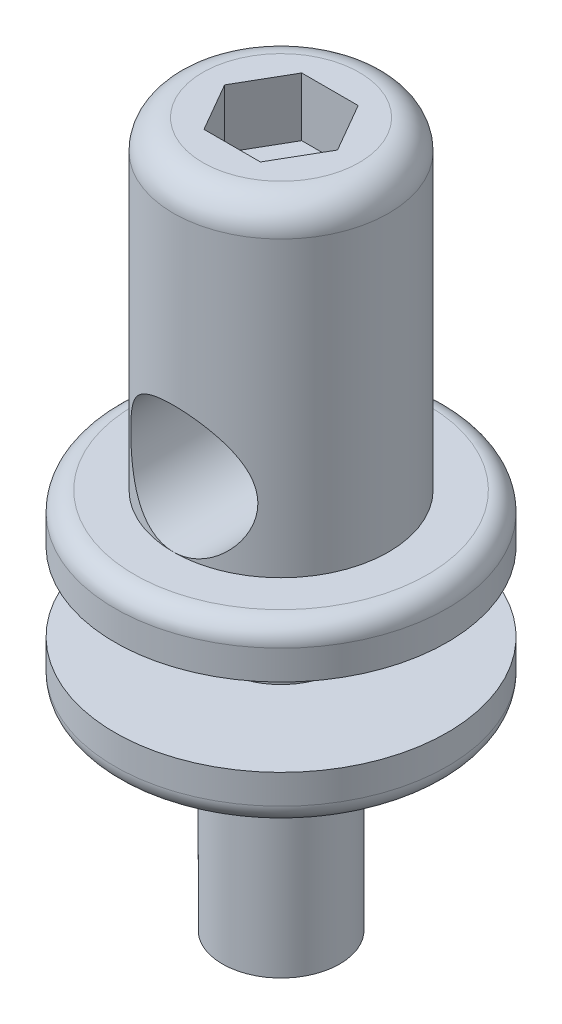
from build123d import *

# Parameters (mm, degrees)
SCHIZZO1_R                    = 5.5
ESTRUSIONE1_DEPTH             = 19
SCHIZZO2_R                    = 3
ESTRUSIONE2_DEPTH             = 17
TAGLIO_ESTRUSIONE1_DEPTH      = 3
RACCORDO1_R                   = 1.5
TAGLIO_ESTRUSIONE2_DEPTH      = 21.530465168
TAGLIO_ESTRUSIONE2_DEPTH_BACK = 21.530465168
SCHIZZO4_R                    = 3.25
SCHIZZO5_R                    = 8.5
SCHIZZO5_R_2                  = 5.5
ESTRUSIONE3_DEPTH             = 2.5
RACCORDO2_R                   = 1
SCHIZZO6_R                    = 8.5
SCHIZZO6_R_2                  = 3
ESTRUSIONE4_DEPTH             = 2.5
RACCORDO3_R                   = 1


with BuildPart() as part:
    # Schizzo1 → Estrusione1 (new body)
    with BuildSketch(Plane(origin=(0, 0, 0), x_dir=(1, 0, 0), z_dir=(0, 1, 0))):
        with Locations(Location((0, 0, 0), (0, 0, 270))):
            Circle(SCHIZZO1_R)
    extrude(amount=ESTRUSIONE1_DEPTH)

    # Schizzo2 → Estrusione2 (add)
    with BuildSketch(Plane.XZ):
        with Locations(Location((0, 0, 0), (0, 0, 90))):
            Circle(SCHIZZO2_R)
    extrude(amount=ESTRUSIONE2_DEPTH)

    # Schizzo3 → Taglio-Estrusione1 (cut)
    with BuildSketch(Plane(origin=(0, 19, 0), x_dir=(-1, 0, 0), z_dir=(0, 1, 0))):
        Polygon((-2.886751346, 0), (-1.443375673, -2.5), (1.443375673, -2.5), (2.886751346, 0), (1.443375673, 2.5), (-1.443375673, 2.5), align=None)
    extrude(amount=-TAGLIO_ESTRUSIONE1_DEPTH, mode=Mode.SUBTRACT)

    # Raccordo1
    raccordo1_edges = [part.edges().sort_by_distance(p)[0] for p in [
        (0, 19, -5.5),
    ]]
    fillet(raccordo1_edges, radius=RACCORDO1_R)

    # Schizzo4 → Taglio-Estrusione2 (cut, two sides: drawn at the far end of the back side and taken through both)
    with BuildSketch(Plane.XY.offset(-TAGLIO_ESTRUSIONE2_DEPTH_BACK)):
        with Locations(Location((0, 5.75, 0), (0, 0, 90.000000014))):
            Circle(SCHIZZO4_R)
    extrude(amount=TAGLIO_ESTRUSIONE2_DEPTH + TAGLIO_ESTRUSIONE2_DEPTH_BACK, mode=Mode.SUBTRACT)


with BuildPart() as body_2:
    # Schizzo5 → Estrusione3 (new body)
    with BuildSketch(Plane.XZ):
        with Locations(Location((0, 0, 0), (0, 0, 270))):
            Circle(SCHIZZO5_R)
        with Locations(Location((0, 0, 0), (0, 0, 270))):
            Circle(SCHIZZO5_R_2, mode=Mode.SUBTRACT)
    extrude(amount=-ESTRUSIONE3_DEPTH)

    # Raccordo2
    raccordo2_edges = [body_2.edges().sort_by_distance(p)[0] for p in [
        (0, 2.5, 8.5),
    ]]
    fillet(raccordo2_edges, radius=RACCORDO2_R)


with BuildPart() as body_3:
    # Schizzo6 → Estrusione4 (new body)
    with BuildSketch(Plane.XZ.offset(4)):
        with Locations(Location((0, 0, 0), (0, 0, 270))):
            Circle(SCHIZZO6_R)
        with Locations(Location((0, 0, 0), (0, 0, 270))):
            Circle(SCHIZZO6_R_2, mode=Mode.SUBTRACT)
    extrude(amount=ESTRUSIONE4_DEPTH)

    # Raccordo3
    raccordo3_edges = [body_3.edges().sort_by_distance(p)[0] for p in [
        (0, -6.5, 8.5),
    ]]
    fillet(raccordo3_edges, radius=RACCORDO3_R)


solid = Compound([part.part, body_2.part, body_3.part])
